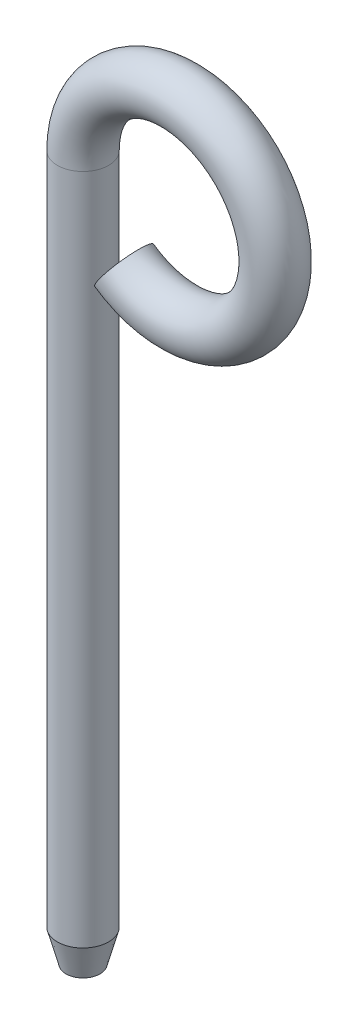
ISO-10303-21;
HEADER;
FILE_DESCRIPTION(('STEP AP214'),'2;1');
FILE_NAME('part.step','',(''),(''),'','','');
FILE_SCHEMA(('AUTOMOTIVE_DESIGN { 1 0 10303 214 1 1 1 1 }'));
ENDSEC;
DATA;
#1=APPLICATION_CONTEXT('core data for automotive mechanical design processes');
#2=APPLICATION_PROTOCOL_DEFINITION('international standard','automotive_design',2000,#1);
#3=PRODUCT_CONTEXT('',#1,'mechanical');
#4=PRODUCT('Part','Part','',(#3));
#5=PRODUCT_RELATED_PRODUCT_CATEGORY('part','',(#4));
#6=PRODUCT_DEFINITION_FORMATION('','',#4);
#7=PRODUCT_DEFINITION_CONTEXT('part definition',#1,'design');
#8=PRODUCT_DEFINITION('design','',#6,#7);
#9=PRODUCT_DEFINITION_SHAPE('','',#8);
#10=(LENGTH_UNIT() NAMED_UNIT(*) SI_UNIT(.MILLI.,.METRE.));
#11=(NAMED_UNIT(*) PLANE_ANGLE_UNIT() SI_UNIT($,.RADIAN.));
#12=(NAMED_UNIT(*) SI_UNIT($,.STERADIAN.) SOLID_ANGLE_UNIT());
#13=UNCERTAINTY_MEASURE_WITH_UNIT(LENGTH_MEASURE(1.E-05),#10,'distance_accuracy_value','');
#14=(GEOMETRIC_REPRESENTATION_CONTEXT(3) GLOBAL_UNCERTAINTY_ASSIGNED_CONTEXT((#13)) GLOBAL_UNIT_ASSIGNED_CONTEXT((#10,
#11,#12)) REPRESENTATION_CONTEXT('',''));
#15=CARTESIAN_POINT('',(0.,0.,0.));
#16=DIRECTION('',(0.,0.,1.));
#17=DIRECTION('',(1.,0.,0.));
#18=AXIS2_PLACEMENT_3D('',#15,#16,#17);
#19=CARTESIAN_POINT('',(14.9999999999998,110.,2.22044604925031E-13));
#20=DIRECTION('',(0.,0.,-1.));
#21=DIRECTION('',(-1.,0.,0.));
#22=AXIS2_PLACEMENT_3D('',#19,#20,#21);
#23=TOROIDAL_SURFACE('',#22,15.,4.);
#24=CARTESIAN_POINT('',(0.,110.,0.));
#25=DIRECTION('',(0.,1.,0.));
#26=DIRECTION('',(0.,0.,1.));
#27=AXIS2_PLACEMENT_3D('',#24,#25,#26);
#28=CIRCLE('',#27,4.);
#29=CARTESIAN_POINT('',(-4.00000000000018,110.,0.));
#30=VERTEX_POINT('',#29);
#31=EDGE_CURVE('E44',#30,#30,#28,.T.);
#32=CARTESIAN_POINT('',(6.39635345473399,97.712719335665,1.94289029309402E-13));
#33=DIRECTION('',(-0.819152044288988,0.573576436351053,0.));
#34=DIRECTION('',(0.,0.,1.));
#35=AXIS2_PLACEMENT_3D('',#32,#33,#34);
#36=CIRCLE('',#35,4.);
#37=CARTESIAN_POINT('',(4.1020477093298,94.4361111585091,1.86887542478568E-13));
#38=VERTEX_POINT('',#37);
#39=EDGE_CURVE('E40',#38,#38,#36,.T.);
#40=CARTESIAN_POINT('',(14.9999999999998,110.,2.22044604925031E-13));
#41=DIRECTION('',(0.,0.,-1.));
#42=DIRECTION('',(-1.,0.,0.));
#43=AXIS2_PLACEMENT_3D('',#40,#41,#42);
#44=CIRCLE('',#43,19.);
#45=EDGE_CURVE('',#30,#38,#44,.T.);
#46=ORIENTED_EDGE('',*,*,#31,.T.);
#47=ORIENTED_EDGE('',*,*,#39,.F.);
#48=ORIENTED_EDGE('',*,*,#45,.T.);
#49=ORIENTED_EDGE('',*,*,#45,.F.);
#50=EDGE_LOOP('',(#46,#48,#47,#49));
#51=FACE_BOUND('',#50,.T.);
#52=ADVANCED_FACE('F30',(#51),#23,.T.);
#53=CARTESIAN_POINT('',(0.,110.,0.));
#54=DIRECTION('',(0.,-1.,0.));
#55=DIRECTION('',(0.,0.,-1.));
#56=AXIS2_PLACEMENT_3D('',#53,#54,#55);
#57=CYLINDRICAL_SURFACE('',#56,4.);
#58=CARTESIAN_POINT('',(3.05311331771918E-13,5.0000000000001,0.));
#59=DIRECTION('',(0.,1.,0.));
#60=DIRECTION('',(0.,0.,1.));
#61=AXIS2_PLACEMENT_3D('',#58,#59,#60);
#62=CIRCLE('',#61,4.);
#63=CARTESIAN_POINT('',(3.05311130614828E-13,5.0000000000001,4.00000000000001));
#64=VERTEX_POINT('',#63);
#65=EDGE_CURVE('E36',#64,#64,#62,.T.);
#66=ORIENTED_EDGE('',*,*,#65,.T.);
#67=EDGE_LOOP('',(#66));
#68=FACE_BOUND('',#67,.T.);
#69=ORIENTED_EDGE('',*,*,#31,.F.);
#70=EDGE_LOOP('',(#69));
#71=FACE_BOUND('',#70,.T.);
#72=ADVANCED_FACE('F52',(#68,#71),#57,.T.);
#73=CARTESIAN_POINT('',(6.39635345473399,97.712719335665,1.94289029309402E-13));
#74=DIRECTION('',(-0.819152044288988,0.573576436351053,0.));
#75=DIRECTION('',(0.,0.,1.));
#76=AXIS2_PLACEMENT_3D('',#73,#74,#75);
#77=PLANE('',#76);
#78=ORIENTED_EDGE('',*,*,#39,.T.);
#79=EDGE_LOOP('',(#78));
#80=FACE_BOUND('',#79,.T.);
#81=ADVANCED_FACE('F54',(#80),#77,.T.);
#82=CARTESIAN_POINT('',(0.,0.,0.));
#83=DIRECTION('',(0.,1.,0.));
#84=DIRECTION('',(0.,0.,1.));
#85=AXIS2_PLACEMENT_3D('',#82,#83,#84);
#86=PLANE('',#85);
#87=CARTESIAN_POINT('',(0.,0.,0.));
#88=DIRECTION('',(0.,1.,0.));
#89=DIRECTION('',(0.,0.,1.));
#90=AXIS2_PLACEMENT_3D('',#87,#88,#89);
#91=CIRCLE('',#90,2.66025403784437);
#92=CARTESIAN_POINT('',(0.,0.,2.66025403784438));
#93=VERTEX_POINT('',#92);
#94=EDGE_CURVE('E10',#93,#93,#91,.F.);
#95=ORIENTED_EDGE('',*,*,#94,.T.);
#96=EDGE_LOOP('',(#95));
#97=FACE_BOUND('',#96,.T.);
#98=ADVANCED_FACE('F59',(#97),#86,.F.);
#99=CARTESIAN_POINT('',(3.05311331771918E-13,5.0000000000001,0.));
#100=DIRECTION('',(0.,1.,0.));
#101=DIRECTION('',(0.,0.,1.));
#102=AXIS2_PLACEMENT_3D('',#99,#100,#101);
#103=CONICAL_SURFACE('',#102,4.,0.261799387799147);
#104=ORIENTED_EDGE('',*,*,#94,.F.);
#105=EDGE_LOOP('',(#104));
#106=FACE_BOUND('',#105,.T.);
#107=ORIENTED_EDGE('',*,*,#65,.F.);
#108=EDGE_LOOP('',(#107));
#109=FACE_BOUND('',#108,.T.);
#110=ADVANCED_FACE('F65',(#106,#109),#103,.T.);
#111=CLOSED_SHELL('',(#52,#72,#81,#98,#110));
#112=MANIFOLD_SOLID_BREP('B2',#111);
#113=ADVANCED_BREP_SHAPE_REPRESENTATION('',(#18,#112),#14);
#114=SHAPE_DEFINITION_REPRESENTATION(#9,#113);
ENDSEC;
END-ISO-10303-21;
